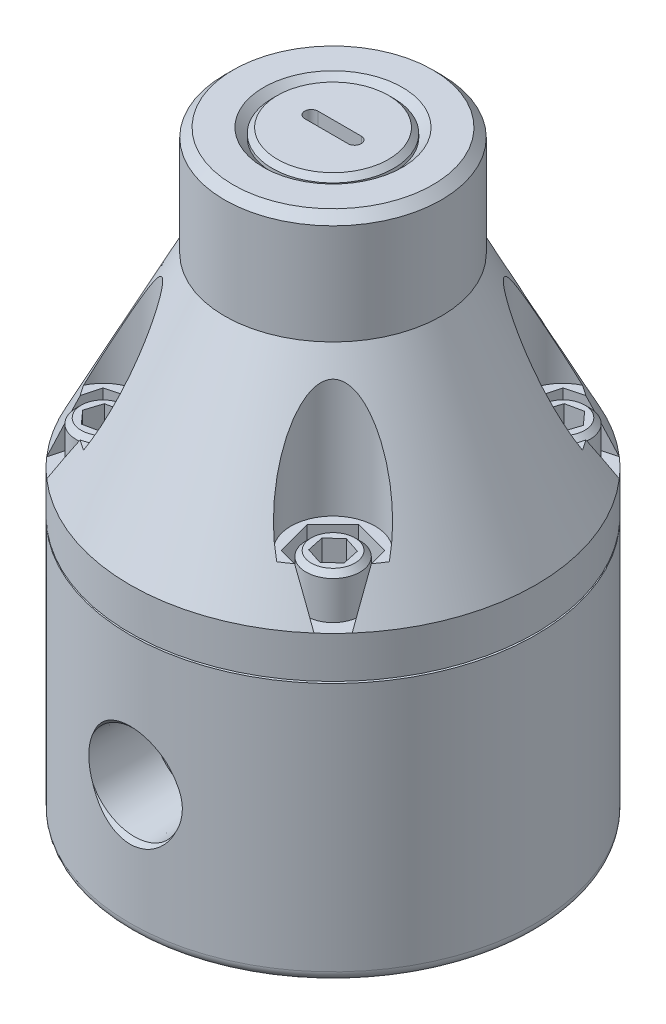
from build123d import *

# Parameters (mm, degrees)
SKETCH1_R                    = 29.718
EXTRUDE1_DEPTH               = 87.63
SKETCH3_R                    = 10.16
EXTRUDE2_DEPTH               = 1.27
EXTRUDE2_DRAFT               = -45
CIRPATTERN1_COUNT            = 2
CHAMFER1_SIZE                = 1.27
FILLET1_R                    = 1.524
EXTRUDE4_REACH               = 99.187
SKETCH7_R                    = 8.89
EXTRUDE5_DEPTH               = 4.7498
CHAMFER4_SIZE                = 0.762
SKETCH11_R                   = 6.1722
EXTRUDE6_DEPTH               = 21.2598
CIRPATTERN2_COUNT            = 4
EXTRUDE7_DEPTH               = 6.35
CIRPATTERN3_COUNT            = 4
SKETCH13_R                   = 3.9624
EXTRUDE8_DEPTH               = 6.35
EXTRUDE9_DEPTH               = 3.175
CHAMFER5_SIZE                = 0.762
CIRPATTERN4_COUNT            = 4
CHAMFER5_OF_CIRPATTERN4_SIZE = 0.762


with BuildPart() as part:
    # Sketch1 → Extrude1 (new body)
    with BuildSketch(Plane(origin=(0, 0, 0), x_dir=(1, 0, 0), z_dir=(0, 1, 0))):
        with Locations(Location((0, 0, 0), (0, 0, 270))):
            Circle(SKETCH1_R)
    extrude(amount=EXTRUDE1_DEPTH)

    # Sketch2 → Cut-Revolve1 (revolve, cut)
    with BuildSketch(Plane.XY, mode=Mode.PRIVATE) as cut_revolve1_sk:
        Polygon((-34.543868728, 38.1), (-19.05, 38.1), (-19.05, 38.354), (-29.718, 38.354), (-29.718, 44.45), (-15.875, 71.628), (-15.875, 89.288493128), (-34.543868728, 89.288493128), align=None)
    revolve(cut_revolve1_sk.sketch.rotate(Axis((0, 0, 0), (0, 1, 0)), 270), axis=Axis((0, 0, 0), (0, 1, 0)), mode=Mode.SUBTRACT)


with BuildPart() as extrude2_tool:
    # Sketch3 → Extrude2 (with draft: the straight prism first)
    with BuildSketch(Plane(origin=(0, 87.63, 0), x_dir=(-1, 0, 0), z_dir=(0, 1, 0))):
        Circle(SKETCH3_R)
    extrude(amount=-EXTRUDE2_DEPTH)
    # Extrude2: the draft: its side faces are tilted about the plane it starts from
    extrude2_sides = [extrude2_tool.faces().sort_by_distance(p)[0] for p in [
        (10.16, 86.995, 0),
    ]]
    draft(extrude2_sides, Plane(origin=(0, 87.63, 0), x_dir=(-1, 0, 0), z_dir=(0, 1, 0)), EXTRUDE2_DRAFT)


with BuildPart() as part_1:
    add(part.part)

    # Extrude2: cut by extrude2_tool
    add(extrude2_tool.part, mode=Mode.SUBTRACT)

    # Sketch6 → 1_4 NPT Tapped Hole5 (revolve, cut)
    with BuildSketch(Plane(origin=(0, 19.05, 29.718), x_dir=(0, -1, 0), z_dir=(1, 0, 0))):
        Polygon((0, 0), (0, 15.004104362), (5.5626, 12.7), (5.5626, 9.906), (6.576997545, 9.906), (6.8545837, 0.635), (7.4895837, 0), align=None)
    f_1_4_npt_tapped_hole5 = revolve(axis=Axis((0, 19.05, 36.068), (0, 0, -1)), mode=Mode.SUBTRACT)

    # CirPattern1: 1_4 NPT Tapped Hole5 ×2 about axis
    cirpattern1_axis = Axis((0, 87.63, 0), (0, -1, 0))
    for i in range(1, CIRPATTERN1_COUNT):
        add(f_1_4_npt_tapped_hole5.rotate(cirpattern1_axis, i * 360 / CIRPATTERN1_COUNT), mode=Mode.SUBTRACT)

    # Chamfer1
    chamfer1_edges = [part_1.edges().sort_by_distance(p)[0] for p in [
        (0, 87.63, 15.875),
    ]]
    chamfer(chamfer1_edges, length=CHAMFER1_SIZE)

    # Fillet1
    fillet1_edges = [part_1.edges().sort_by_distance(p)[0] for p in [
        (0, 0, -29.718),
    ]]
    fillet(fillet1_edges, radius=FILLET1_R)

    # Extrude4: up to this cone (the profile starts inside it)
    extrude4_end = Plane(origin=(0, 87.63, 0), z_dir=(0, 1, 0)).offset(-10.159999) * Cone(1e-06, 120.007, 120.006999, align=(Align.CENTER, Align.CENTER, Align.MIN), mode=Mode.PRIVATE)
    # Sketch7 → Extrude4 (add, up to the surface)
    with BuildSketch(Plane(origin=(0, 87.63, 0), x_dir=(-1, 0, 0), z_dir=(0, 1, 0)), mode=Mode.PRIVATE) as extrude4_sk1:
        with Locations(Location((0, 0, 0), (0, 0, 90))):
            Circle(SKETCH7_R)
    extrude4_tool1 = extrude(extrude4_sk1.sketch, amount=-EXTRUDE4_REACH, mode=Mode.PRIVATE) & extrude4_end
    add(extrude4_tool1.solids().sort_by_distance((0, 87.63, 0))[0])

    # Sketch10 → Extrude5 (cut)
    with BuildSketch(Plane(origin=(0, 87.63, 0), x_dir=(-1, 0, 0), z_dir=(0, 1, 0))):
        with BuildLine():
            Line((-3.175, 0.9652), (3.175, 0.9652))
            ThreePointArc((3.175, 0.9652), (4.1402, 0), (3.175, -0.9652))
            Line((3.175, -0.9652), (-3.175, -0.9652))
            ThreePointArc((-3.175, -0.9652), (-4.1402, 0), (-3.175, 0.9652))
        make_face()
    extrude(amount=-EXTRUDE5_DEPTH, mode=Mode.SUBTRACT)

    # Chamfer4
    chamfer4_edges = [part_1.edges().sort_by_distance(p)[0] for p in [
        (0, 87.63, -8.89),
    ]]
    chamfer(chamfer4_edges, length=CHAMFER4_SIZE)

    # Sketch11 → Extrude6 (cut)
    with BuildSketch(Plane(origin=(0, 50.8, 0), x_dir=(-1, 0, 0), z_dir=(0, 1, 0))):
        with Locations((-16.837980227, -16.837980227)):
            Circle(SKETCH11_R)
    extrude6 = extrude(amount=EXTRUDE6_DEPTH, mode=Mode.SUBTRACT)

    # CirPattern2: Extrude6 ×4 about axis
    cirpattern2_axis = Axis((0, 0, 0), (0, 1, 0))
    for i in range(1, CIRPATTERN2_COUNT):
        add(extrude6.rotate(cirpattern2_axis, i * 360 / CIRPATTERN2_COUNT), mode=Mode.SUBTRACT)

    # Sketch12 → Extrude7 (cut)
    with BuildSketch(Plane(origin=(0, 50.8, 0), x_dir=(-1, 0, 0), z_dir=(0, 1, 0))):
        Polygon((-20.625559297, -13.064574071), (-23.373711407, -23.398259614), (-13.050401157, -20.611386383), (-11.676325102, -15.444543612), (-15.463904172, -11.671137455), align=None)
    extrude7 = extrude(amount=-EXTRUDE7_DEPTH, mode=Mode.SUBTRACT)

    # CirPattern3: Extrude7 ×4 about axis
    cirpattern3_axis = Axis((0, 0, 0), (0, 1, 0))
    for i in range(1, CIRPATTERN3_COUNT):
        add(extrude7.rotate(cirpattern3_axis, i * 360 / CIRPATTERN3_COUNT), mode=Mode.SUBTRACT)

    # Sketch13 → Extrude8 (add)
    with BuildSketch(Plane(origin=(0, 50.8, 0), x_dir=(-1, 0, 0), z_dir=(0, 1, 0))):
        with Locations(Location((-16.832776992, -16.843181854, 0), (0, 0, 90))):
            Circle(SKETCH13_R)
    extrude8 = extrude(amount=-EXTRUDE8_DEPTH)

    # Sketch14 → Extrude9 (cut)
    with BuildSketch(Plane(origin=(0, 50.8, 0), x_dir=(-1, 0, 0), z_dir=(0, 1, 0))):
        Polygon((-15.143118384, -18.718782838), (-14.36362959, -16.317695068), (-16.053288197, -14.442094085), (-18.5224356, -14.967580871), (-19.301924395, -17.368668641), (-17.612265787, -19.244269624), align=None)
    extrude9 = extrude(amount=-EXTRUDE9_DEPTH, mode=Mode.SUBTRACT)

    # Chamfer5
    chamfer5_edges = [part_1.edges().sort_by_distance(p)[0] for p in [
        (16.832776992, 50.8, -20.805581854),
    ]]
    chamfer(chamfer5_edges, length=CHAMFER5_SIZE)

    # CirPattern4: Extrude8, Extrude9 ×4 about axis
    cirpattern4_axis = Axis((0, 0, 0), (0, 1, 0))
    add([extrude8.rotate(cirpattern4_axis, i * 360 / CIRPATTERN4_COUNT) for i in range(1, CIRPATTERN4_COUNT)])
    add([extrude9.rotate(cirpattern4_axis, i * 360 / CIRPATTERN4_COUNT) for i in range(1, CIRPATTERN4_COUNT)], mode=Mode.SUBTRACT)

    # Chamfer5 of CirPattern4
    chamfer5_of_cirpattern4_edges = [part_1.edges().sort_by_distance(p)[0] for p in [
        (-20.805581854, 50.8, -16.832776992),
        (-16.832776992, 50.8, 20.805581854),
        (20.805581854, 50.8, 16.832776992),
    ]]
    chamfer(chamfer5_of_cirpattern4_edges, length=CHAMFER5_OF_CIRPATTERN4_SIZE)


solid = part_1.part
